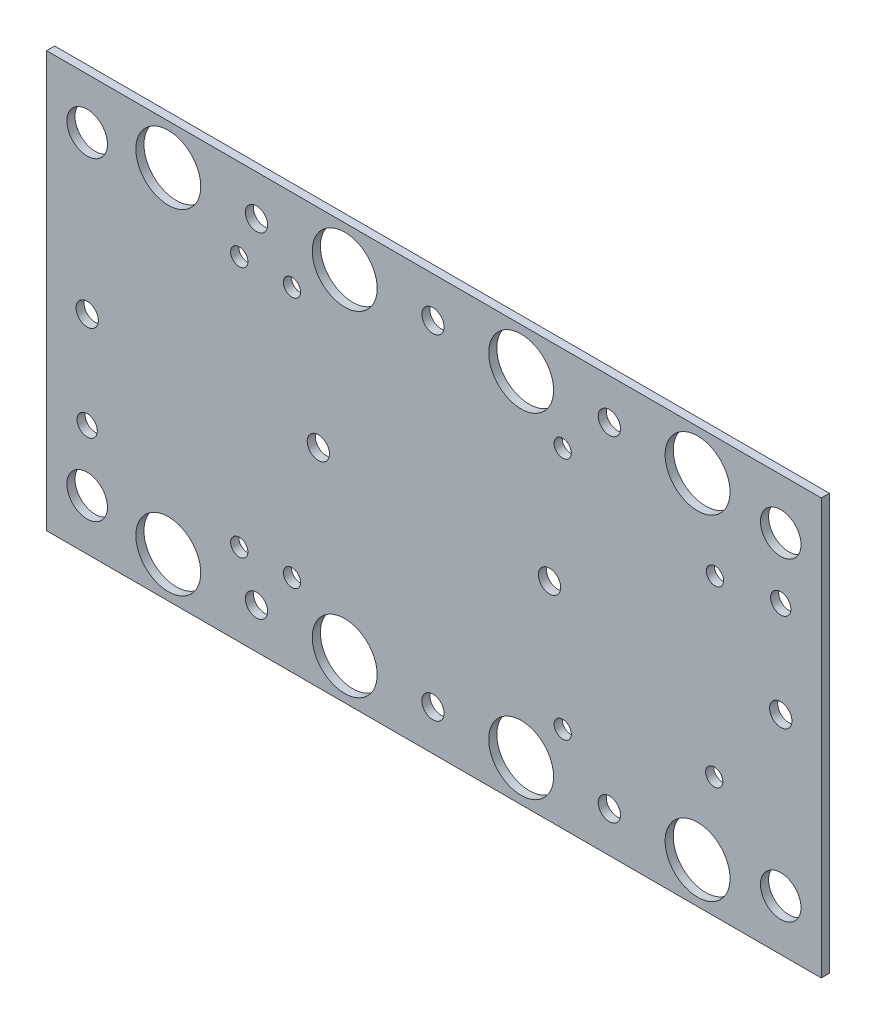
ISO-10303-21;
HEADER;
FILE_DESCRIPTION(('STEP AP214'),'2;1');
FILE_NAME('part.step','',(''),(''),'','','');
FILE_SCHEMA(('AUTOMOTIVE_DESIGN { 1 0 10303 214 1 1 1 1 }'));
ENDSEC;
DATA;
#1=APPLICATION_CONTEXT('core data for automotive mechanical design processes');
#2=APPLICATION_PROTOCOL_DEFINITION('international standard','automotive_design',2000,#1);
#3=PRODUCT_CONTEXT('',#1,'mechanical');
#4=PRODUCT('Part','Part','',(#3));
#5=PRODUCT_RELATED_PRODUCT_CATEGORY('part','',(#4));
#6=PRODUCT_DEFINITION_FORMATION('','',#4);
#7=PRODUCT_DEFINITION_CONTEXT('part definition',#1,'design');
#8=PRODUCT_DEFINITION('design','',#6,#7);
#9=PRODUCT_DEFINITION_SHAPE('','',#8);
#10=(LENGTH_UNIT() NAMED_UNIT(*) SI_UNIT(.MILLI.,.METRE.));
#11=(NAMED_UNIT(*) PLANE_ANGLE_UNIT() SI_UNIT($,.RADIAN.));
#12=(NAMED_UNIT(*) SI_UNIT($,.STERADIAN.) SOLID_ANGLE_UNIT());
#13=UNCERTAINTY_MEASURE_WITH_UNIT(LENGTH_MEASURE(1.E-05),#10,'distance_accuracy_value','');
#14=(GEOMETRIC_REPRESENTATION_CONTEXT(3) GLOBAL_UNCERTAINTY_ASSIGNED_CONTEXT((#13)) GLOBAL_UNIT_ASSIGNED_CONTEXT((#10,
#11,#12)) REPRESENTATION_CONTEXT('',''));
#15=CARTESIAN_POINT('',(0.,0.,0.));
#16=DIRECTION('',(0.,0.,1.));
#17=DIRECTION('',(1.,0.,0.));
#18=AXIS2_PLACEMENT_3D('',#15,#16,#17);
#19=CARTESIAN_POINT('',(19.9999999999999,-275.,4.));
#20=DIRECTION('',(0.,0.,1.));
#21=DIRECTION('',(1.,0.,0.));
#22=AXIS2_PLACEMENT_3D('',#19,#20,#21);
#23=PLANE('',#22);
#24=CARTESIAN_POINT('',(141.,-234.5,4.));
#25=DIRECTION('',(0.,0.,-1.));
#26=DIRECTION('',(-1.,0.,0.));
#27=AXIS2_PLACEMENT_3D('',#24,#25,#26);
#28=CIRCLE('',#27,4.25000000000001);
#29=CARTESIAN_POINT('',(136.75,-234.5,4.));
#30=VERTEX_POINT('',#29);
#31=EDGE_CURVE('E524',#30,#30,#28,.T.);
#32=ORIENTED_EDGE('',*,*,#31,.T.);
#33=EDGE_LOOP('',(#32));
#34=FACE_BOUND('',#33,.T.);
#35=CARTESIAN_POINT('',(115.,-234.5,4.));
#36=DIRECTION('',(0.,0.,-1.));
#37=DIRECTION('',(-1.,0.,0.));
#38=AXIS2_PLACEMENT_3D('',#35,#36,#37);
#39=CIRCLE('',#38,4.25000000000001);
#40=CARTESIAN_POINT('',(110.75,-234.5,4.));
#41=VERTEX_POINT('',#40);
#42=EDGE_CURVE('E534',#41,#41,#39,.T.);
#43=ORIENTED_EDGE('',*,*,#42,.T.);
#44=EDGE_LOOP('',(#43));
#45=FACE_BOUND('',#44,.T.);
#46=CARTESIAN_POINT('',(115.,-110.499999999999,4.));
#47=DIRECTION('',(0.,0.,-1.));
#48=DIRECTION('',(-1.,0.,0.));
#49=AXIS2_PLACEMENT_3D('',#46,#47,#48);
#50=CIRCLE('',#49,4.25000000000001);
#51=CARTESIAN_POINT('',(110.75,-110.499999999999,4.));
#52=VERTEX_POINT('',#51);
#53=EDGE_CURVE('E540',#52,#52,#50,.T.);
#54=ORIENTED_EDGE('',*,*,#53,.T.);
#55=EDGE_LOOP('',(#54));
#56=FACE_BOUND('',#55,.T.);
#57=CARTESIAN_POINT('',(141.,-110.499999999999,4.));
#58=DIRECTION('',(0.,0.,-1.));
#59=DIRECTION('',(-1.,0.,0.));
#60=AXIS2_PLACEMENT_3D('',#57,#58,#59);
#61=CIRCLE('',#60,4.25000000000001);
#62=CARTESIAN_POINT('',(136.75,-110.499999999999,4.));
#63=VERTEX_POINT('',#62);
#64=EDGE_CURVE('E546',#63,#63,#61,.T.);
#65=ORIENTED_EDGE('',*,*,#64,.T.);
#66=EDGE_LOOP('',(#65));
#67=FACE_BOUND('',#66,.T.);
#68=CARTESIAN_POINT('',(274.5,-232.499999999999,4.));
#69=DIRECTION('',(0.,0.,-1.));
#70=DIRECTION('',(-1.,0.,0.));
#71=AXIS2_PLACEMENT_3D('',#68,#69,#70);
#72=CIRCLE('',#71,4.24999999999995);
#73=CARTESIAN_POINT('',(270.25,-232.499999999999,4.));
#74=VERTEX_POINT('',#73);
#75=EDGE_CURVE('E552',#74,#74,#72,.T.);
#76=ORIENTED_EDGE('',*,*,#75,.T.);
#77=EDGE_LOOP('',(#76));
#78=FACE_BOUND('',#77,.T.);
#79=CARTESIAN_POINT('',(274.5,-112.499999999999,4.));
#80=DIRECTION('',(0.,0.,-1.));
#81=DIRECTION('',(-1.,0.,0.));
#82=AXIS2_PLACEMENT_3D('',#79,#80,#81);
#83=CIRCLE('',#82,4.24999999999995);
#84=CARTESIAN_POINT('',(270.25,-112.499999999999,4.));
#85=VERTEX_POINT('',#84);
#86=EDGE_CURVE('E558',#85,#85,#83,.T.);
#87=ORIENTED_EDGE('',*,*,#86,.T.);
#88=EDGE_LOOP('',(#87));
#89=FACE_BOUND('',#88,.T.);
#90=CARTESIAN_POINT('',(349.2132642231,-215.499999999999,4.));
#91=DIRECTION('',(0.,0.,-1.));
#92=DIRECTION('',(-1.,0.,0.));
#93=AXIS2_PLACEMENT_3D('',#90,#91,#92);
#94=CIRCLE('',#93,4.24999999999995);
#95=CARTESIAN_POINT('',(344.9632642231,-215.499999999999,4.));
#96=VERTEX_POINT('',#95);
#97=EDGE_CURVE('E564',#96,#96,#94,.T.);
#98=ORIENTED_EDGE('',*,*,#97,.T.);
#99=EDGE_LOOP('',(#98));
#100=FACE_BOUND('',#99,.T.);
#101=CARTESIAN_POINT('',(349.551704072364,-129.499999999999,4.));
#102=DIRECTION('',(0.,0.,-1.));
#103=DIRECTION('',(-1.,0.,0.));
#104=AXIS2_PLACEMENT_3D('',#101,#102,#103);
#105=CIRCLE('',#104,4.24999999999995);
#106=CARTESIAN_POINT('',(345.301704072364,-129.499999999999,4.));
#107=VERTEX_POINT('',#106);
#108=EDGE_CURVE('E570',#107,#107,#105,.T.);
#109=ORIENTED_EDGE('',*,*,#108,.T.);
#110=EDGE_LOOP('',(#109));
#111=FACE_BOUND('',#110,.T.);
#112=CARTESIAN_POINT('',(39.9999999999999,-220.,4.));
#113=DIRECTION('',(0.,0.,1.));
#114=DIRECTION('',(1.,0.,0.));
#115=AXIS2_PLACEMENT_3D('',#112,#113,#114);
#116=CIRCLE('',#115,5.);
#117=CARTESIAN_POINT('',(44.9999999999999,-220.,4.));
#118=VERTEX_POINT('',#117);
#119=EDGE_CURVE('E573',#118,#118,#116,.T.);
#120=ORIENTED_EDGE('',*,*,#119,.F.);
#121=EDGE_LOOP('',(#120));
#122=FACE_BOUND('',#121,.T.);
#123=CARTESIAN_POINT('',(382.,-125.,4.));
#124=DIRECTION('',(0.,0.,1.));
#125=DIRECTION('',(1.,0.,0.));
#126=AXIS2_PLACEMENT_3D('',#123,#124,#125);
#127=CIRCLE('',#126,4.99999999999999);
#128=CARTESIAN_POINT('',(387.,-125.,4.));
#129=VERTEX_POINT('',#128);
#130=EDGE_CURVE('E579',#129,#129,#127,.T.);
#131=ORIENTED_EDGE('',*,*,#130,.F.);
#132=EDGE_LOOP('',(#131));
#133=FACE_BOUND('',#132,.T.);
#134=CARTESIAN_POINT('',(297.5,-255.,4.));
#135=DIRECTION('',(0.,0.,-1.));
#136=DIRECTION('',(-1.,0.,0.));
#137=AXIS2_PLACEMENT_3D('',#134,#135,#136);
#138=CIRCLE('',#137,5.50000000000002);
#139=CARTESIAN_POINT('',(292.,-255.,4.));
#140=VERTEX_POINT('',#139);
#141=EDGE_CURVE('E588',#140,#140,#138,.T.);
#142=ORIENTED_EDGE('',*,*,#141,.T.);
#143=EDGE_LOOP('',(#142));
#144=FACE_BOUND('',#143,.T.);
#145=CARTESIAN_POINT('',(210.5,-255.,4.));
#146=DIRECTION('',(0.,0.,-1.));
#147=DIRECTION('',(-1.,0.,0.));
#148=AXIS2_PLACEMENT_3D('',#145,#146,#147);
#149=CIRCLE('',#148,5.50000000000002);
#150=CARTESIAN_POINT('',(205.,-255.,4.));
#151=VERTEX_POINT('',#150);
#152=EDGE_CURVE('E594',#151,#151,#149,.T.);
#153=ORIENTED_EDGE('',*,*,#152,.T.);
#154=EDGE_LOOP('',(#153));
#155=FACE_BOUND('',#154,.T.);
#156=CARTESIAN_POINT('',(123.499999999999,-255.,4.));
#157=DIRECTION('',(0.,0.,-1.));
#158=DIRECTION('',(-1.,0.,0.));
#159=AXIS2_PLACEMENT_3D('',#156,#157,#158);
#160=CIRCLE('',#159,5.5);
#161=CARTESIAN_POINT('',(117.999999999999,-255.,4.));
#162=VERTEX_POINT('',#161);
#163=EDGE_CURVE('E600',#162,#162,#160,.T.);
#164=ORIENTED_EDGE('',*,*,#163,.T.);
#165=EDGE_LOOP('',(#164));
#166=FACE_BOUND('',#165,.T.);
#167=CARTESIAN_POINT('',(39.9999999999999,-172.499999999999,4.));
#168=DIRECTION('',(0.,0.,-1.));
#169=DIRECTION('',(-1.,0.,0.));
#170=AXIS2_PLACEMENT_3D('',#167,#168,#169);
#171=CIRCLE('',#170,5.5);
#172=CARTESIAN_POINT('',(34.4999999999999,-172.499999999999,4.));
#173=VERTEX_POINT('',#172);
#174=EDGE_CURVE('E606',#173,#173,#171,.T.);
#175=ORIENTED_EDGE('',*,*,#174,.T.);
#176=EDGE_LOOP('',(#175));
#177=FACE_BOUND('',#176,.T.);
#178=CARTESIAN_POINT('',(154.,-172.499999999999,4.));
#179=DIRECTION('',(0.,0.,-1.));
#180=DIRECTION('',(-1.,0.,0.));
#181=AXIS2_PLACEMENT_3D('',#178,#179,#180);
#182=CIRCLE('',#181,5.50000000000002);
#183=CARTESIAN_POINT('',(148.5,-172.499999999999,4.));
#184=VERTEX_POINT('',#183);
#185=EDGE_CURVE('E612',#184,#184,#182,.T.);
#186=ORIENTED_EDGE('',*,*,#185,.T.);
#187=EDGE_LOOP('',(#186));
#188=FACE_BOUND('',#187,.T.);
#189=CARTESIAN_POINT('',(268.,-172.499999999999,4.));
#190=DIRECTION('',(0.,0.,-1.));
#191=DIRECTION('',(-1.,0.,0.));
#192=AXIS2_PLACEMENT_3D('',#189,#190,#191);
#193=CIRCLE('',#192,5.50000000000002);
#194=CARTESIAN_POINT('',(262.5,-172.499999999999,4.));
#195=VERTEX_POINT('',#194);
#196=EDGE_CURVE('E618',#195,#195,#193,.T.);
#197=ORIENTED_EDGE('',*,*,#196,.T.);
#198=EDGE_LOOP('',(#197));
#199=FACE_BOUND('',#198,.T.);
#200=CARTESIAN_POINT('',(382.,-172.499999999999,4.));
#201=DIRECTION('',(0.,0.,-1.));
#202=DIRECTION('',(-1.,0.,0.));
#203=AXIS2_PLACEMENT_3D('',#200,#201,#202);
#204=CIRCLE('',#203,5.50000000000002);
#205=CARTESIAN_POINT('',(376.5,-172.499999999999,4.));
#206=VERTEX_POINT('',#205);
#207=EDGE_CURVE('E624',#206,#206,#204,.T.);
#208=ORIENTED_EDGE('',*,*,#207,.T.);
#209=EDGE_LOOP('',(#208));
#210=FACE_BOUND('',#209,.T.);
#211=CARTESIAN_POINT('',(123.5,-89.9999999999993,4.));
#212=DIRECTION('',(0.,0.,-1.));
#213=DIRECTION('',(-1.,0.,0.));
#214=AXIS2_PLACEMENT_3D('',#211,#212,#213);
#215=CIRCLE('',#214,5.5);
#216=CARTESIAN_POINT('',(118.,-89.9999999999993,4.));
#217=VERTEX_POINT('',#216);
#218=EDGE_CURVE('E630',#217,#217,#215,.T.);
#219=ORIENTED_EDGE('',*,*,#218,.T.);
#220=EDGE_LOOP('',(#219));
#221=FACE_BOUND('',#220,.T.);
#222=CARTESIAN_POINT('',(210.5,-89.9999999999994,4.));
#223=DIRECTION('',(0.,0.,-1.));
#224=DIRECTION('',(-1.,0.,0.));
#225=AXIS2_PLACEMENT_3D('',#222,#223,#224);
#226=CIRCLE('',#225,5.50000000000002);
#227=CARTESIAN_POINT('',(205.,-89.9999999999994,4.));
#228=VERTEX_POINT('',#227);
#229=EDGE_CURVE('E636',#228,#228,#226,.T.);
#230=ORIENTED_EDGE('',*,*,#229,.T.);
#231=EDGE_LOOP('',(#230));
#232=FACE_BOUND('',#231,.T.);
#233=CARTESIAN_POINT('',(297.5,-89.9999999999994,4.));
#234=DIRECTION('',(0.,0.,-1.));
#235=DIRECTION('',(-1.,0.,0.));
#236=AXIS2_PLACEMENT_3D('',#233,#234,#235);
#237=CIRCLE('',#236,5.50000000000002);
#238=CARTESIAN_POINT('',(292.,-89.9999999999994,4.));
#239=VERTEX_POINT('',#238);
#240=EDGE_CURVE('E147',#239,#239,#237,.T.);
#241=ORIENTED_EDGE('',*,*,#240,.T.);
#242=EDGE_LOOP('',(#241));
#243=FACE_BOUND('',#242,.T.);
#244=CARTESIAN_POINT('',(167.,-255.,4.));
#245=DIRECTION('',(0.,0.,1.));
#246=DIRECTION('',(1.,0.,0.));
#247=AXIS2_PLACEMENT_3D('',#244,#245,#246);
#248=CIRCLE('',#247,16.);
#249=CARTESIAN_POINT('',(183.,-255.,4.));
#250=VERTEX_POINT('',#249);
#251=EDGE_CURVE('E144',#250,#250,#248,.T.);
#252=ORIENTED_EDGE('',*,*,#251,.F.);
#253=EDGE_LOOP('',(#252));
#254=FACE_BOUND('',#253,.T.);
#255=CARTESIAN_POINT('',(341.,-255.,4.));
#256=DIRECTION('',(0.,0.,1.));
#257=DIRECTION('',(1.,0.,0.));
#258=AXIS2_PLACEMENT_3D('',#255,#256,#257);
#259=CIRCLE('',#258,16.0000000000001);
#260=CARTESIAN_POINT('',(357.,-255.,4.));
#261=VERTEX_POINT('',#260);
#262=EDGE_CURVE('E160',#261,#261,#259,.T.);
#263=ORIENTED_EDGE('',*,*,#262,.F.);
#264=EDGE_LOOP('',(#263));
#265=FACE_BOUND('',#264,.T.);
#266=CARTESIAN_POINT('',(39.9999999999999,-95.,4.));
#267=DIRECTION('',(0.,0.,1.));
#268=DIRECTION('',(1.,0.,0.));
#269=AXIS2_PLACEMENT_3D('',#266,#267,#268);
#270=CIRCLE('',#269,10.);
#271=CARTESIAN_POINT('',(49.9999999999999,-95.,4.));
#272=VERTEX_POINT('',#271);
#273=EDGE_CURVE('E170',#272,#272,#270,.T.);
#274=ORIENTED_EDGE('',*,*,#273,.F.);
#275=EDGE_LOOP('',(#274));
#276=FACE_BOUND('',#275,.T.);
#277=CARTESIAN_POINT('',(382.,-250.,4.));
#278=DIRECTION('',(0.,0.,1.));
#279=DIRECTION('',(1.,0.,0.));
#280=AXIS2_PLACEMENT_3D('',#277,#278,#279);
#281=CIRCLE('',#280,9.99999999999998);
#282=CARTESIAN_POINT('',(392.,-250.,4.));
#283=VERTEX_POINT('',#282);
#284=EDGE_CURVE('E180',#283,#283,#281,.T.);
#285=ORIENTED_EDGE('',*,*,#284,.F.);
#286=EDGE_LOOP('',(#285));
#287=FACE_BOUND('',#286,.T.);
#288=CARTESIAN_POINT('',(167.,-90.,4.));
#289=DIRECTION('',(0.,0.,1.));
#290=DIRECTION('',(1.,0.,0.));
#291=AXIS2_PLACEMENT_3D('',#288,#289,#290);
#292=CIRCLE('',#291,16.);
#293=CARTESIAN_POINT('',(183.,-90.,4.));
#294=VERTEX_POINT('',#293);
#295=EDGE_CURVE('E190',#294,#294,#292,.T.);
#296=ORIENTED_EDGE('',*,*,#295,.F.);
#297=EDGE_LOOP('',(#296));
#298=FACE_BOUND('',#297,.T.);
#299=CARTESIAN_POINT('',(341.,-90.,4.));
#300=DIRECTION('',(0.,0.,1.));
#301=DIRECTION('',(1.,0.,0.));
#302=AXIS2_PLACEMENT_3D('',#299,#300,#301);
#303=CIRCLE('',#302,16.0000000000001);
#304=CARTESIAN_POINT('',(357.,-90.,4.));
#305=VERTEX_POINT('',#304);
#306=EDGE_CURVE('E90',#305,#305,#303,.T.);
#307=ORIENTED_EDGE('',*,*,#306,.F.);
#308=EDGE_LOOP('',(#307));
#309=FACE_BOUND('',#308,.T.);
#310=DIRECTION('',(0.,-1.,0.));
#311=VECTOR('',#310,1.);
#312=CARTESIAN_POINT('',(19.9999999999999,-70.,4.));
#313=LINE('',#312,#311);
#314=CARTESIAN_POINT('',(19.9999999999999,-70.,4.));
#315=VERTEX_POINT('',#314);
#316=CARTESIAN_POINT('',(19.9999999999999,-275.,4.));
#317=VERTEX_POINT('',#316);
#318=EDGE_CURVE('E100',#315,#317,#313,.T.);
#319=ORIENTED_EDGE('',*,*,#318,.T.);
#320=DIRECTION('',(1.,0.,0.));
#321=VECTOR('',#320,1.);
#322=CARTESIAN_POINT('',(19.9999999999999,-275.,4.));
#323=LINE('',#322,#321);
#324=CARTESIAN_POINT('',(402.,-275.,4.));
#325=VERTEX_POINT('',#324);
#326=EDGE_CURVE('E85',#317,#325,#323,.T.);
#327=ORIENTED_EDGE('',*,*,#326,.T.);
#328=DIRECTION('',(0.,1.,0.));
#329=VECTOR('',#328,1.);
#330=CARTESIAN_POINT('',(402.,-275.,4.));
#331=LINE('',#330,#329);
#332=CARTESIAN_POINT('',(402.,-70.,4.));
#333=VERTEX_POINT('',#332);
#334=EDGE_CURVE('E51',#325,#333,#331,.T.);
#335=ORIENTED_EDGE('',*,*,#334,.T.);
#336=DIRECTION('',(-1.,0.,0.));
#337=VECTOR('',#336,1.);
#338=CARTESIAN_POINT('',(402.,-70.,4.));
#339=LINE('',#338,#337);
#340=EDGE_CURVE('E46',#333,#315,#339,.T.);
#341=ORIENTED_EDGE('',*,*,#340,.T.);
#342=EDGE_LOOP('',(#319,#327,#335,#341));
#343=FACE_BOUND('',#342,.T.);
#344=CARTESIAN_POINT('',(254.,-90.,4.));
#345=DIRECTION('',(0.,0.,1.));
#346=DIRECTION('',(1.,0.,0.));
#347=AXIS2_PLACEMENT_3D('',#344,#345,#346);
#348=CIRCLE('',#347,16.);
#349=CARTESIAN_POINT('',(270.,-90.,4.));
#350=VERTEX_POINT('',#349);
#351=EDGE_CURVE('E119',#350,#350,#348,.T.);
#352=ORIENTED_EDGE('',*,*,#351,.F.);
#353=EDGE_LOOP('',(#352));
#354=FACE_BOUND('',#353,.T.);
#355=CARTESIAN_POINT('',(79.9999999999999,-90.,4.));
#356=DIRECTION('',(0.,0.,1.));
#357=DIRECTION('',(1.,0.,0.));
#358=AXIS2_PLACEMENT_3D('',#355,#356,#357);
#359=CIRCLE('',#358,16.);
#360=CARTESIAN_POINT('',(95.9999999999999,-90.,4.));
#361=VERTEX_POINT('',#360);
#362=EDGE_CURVE('E123',#361,#361,#359,.T.);
#363=ORIENTED_EDGE('',*,*,#362,.F.);
#364=EDGE_LOOP('',(#363));
#365=FACE_BOUND('',#364,.T.);
#366=CARTESIAN_POINT('',(39.9999999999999,-250.,4.));
#367=DIRECTION('',(0.,0.,1.));
#368=DIRECTION('',(1.,0.,0.));
#369=AXIS2_PLACEMENT_3D('',#366,#367,#368);
#370=CIRCLE('',#369,10.);
#371=CARTESIAN_POINT('',(49.9999999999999,-250.,4.));
#372=VERTEX_POINT('',#371);
#373=EDGE_CURVE('E127',#372,#372,#370,.T.);
#374=ORIENTED_EDGE('',*,*,#373,.F.);
#375=EDGE_LOOP('',(#374));
#376=FACE_BOUND('',#375,.T.);
#377=CARTESIAN_POINT('',(382.,-95.,4.));
#378=DIRECTION('',(0.,0.,1.));
#379=DIRECTION('',(1.,0.,0.));
#380=AXIS2_PLACEMENT_3D('',#377,#378,#379);
#381=CIRCLE('',#380,10.);
#382=CARTESIAN_POINT('',(392.,-95.,4.));
#383=VERTEX_POINT('',#382);
#384=EDGE_CURVE('E131',#383,#383,#381,.T.);
#385=ORIENTED_EDGE('',*,*,#384,.F.);
#386=EDGE_LOOP('',(#385));
#387=FACE_BOUND('',#386,.T.);
#388=CARTESIAN_POINT('',(254.,-255.,4.));
#389=DIRECTION('',(0.,0.,1.));
#390=DIRECTION('',(1.,0.,0.));
#391=AXIS2_PLACEMENT_3D('',#388,#389,#390);
#392=CIRCLE('',#391,16.);
#393=CARTESIAN_POINT('',(270.,-255.,4.));
#394=VERTEX_POINT('',#393);
#395=EDGE_CURVE('E135',#394,#394,#392,.T.);
#396=ORIENTED_EDGE('',*,*,#395,.F.);
#397=EDGE_LOOP('',(#396));
#398=FACE_BOUND('',#397,.T.);
#399=CARTESIAN_POINT('',(79.9999999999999,-255.,4.));
#400=DIRECTION('',(0.,0.,1.));
#401=DIRECTION('',(1.,0.,0.));
#402=AXIS2_PLACEMENT_3D('',#399,#400,#401);
#403=CIRCLE('',#402,16.);
#404=CARTESIAN_POINT('',(95.9999999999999,-255.,4.));
#405=VERTEX_POINT('',#404);
#406=EDGE_CURVE('E138',#405,#405,#403,.T.);
#407=ORIENTED_EDGE('',*,*,#406,.F.);
#408=EDGE_LOOP('',(#407));
#409=FACE_BOUND('',#408,.T.);
#410=ADVANCED_FACE('F31',(#34,#45,#56,#67,#78,#89,#100,#111,#122,#133,#144,#155,#166,#177,#188,
#199,#210,#221,#232,#243,#254,#265,#276,#287,#298,#309,#343,#354,#365,#376,#387,#398,#409),#23,.T.);
#411=CARTESIAN_POINT('',(19.9999999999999,-275.,0.));
#412=DIRECTION('',(0.,0.,1.));
#413=DIRECTION('',(1.,0.,0.));
#414=AXIS2_PLACEMENT_3D('',#411,#412,#413);
#415=PLANE('',#414);
#416=CARTESIAN_POINT('',(141.,-234.5,0.));
#417=DIRECTION('',(0.,0.,-1.));
#418=DIRECTION('',(-1.,0.,0.));
#419=AXIS2_PLACEMENT_3D('',#416,#417,#418);
#420=CIRCLE('',#419,4.25000000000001);
#421=CARTESIAN_POINT('',(136.75,-234.5,0.));
#422=VERTEX_POINT('',#421);
#423=EDGE_CURVE('E527',#422,#422,#420,.T.);
#424=ORIENTED_EDGE('',*,*,#423,.F.);
#425=EDGE_LOOP('',(#424));
#426=FACE_BOUND('',#425,.T.);
#427=CARTESIAN_POINT('',(115.,-234.5,0.));
#428=DIRECTION('',(0.,0.,-1.));
#429=DIRECTION('',(-1.,0.,0.));
#430=AXIS2_PLACEMENT_3D('',#427,#428,#429);
#431=CIRCLE('',#430,4.25000000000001);
#432=CARTESIAN_POINT('',(110.75,-234.5,0.));
#433=VERTEX_POINT('',#432);
#434=EDGE_CURVE('E529',#433,#433,#431,.T.);
#435=ORIENTED_EDGE('',*,*,#434,.F.);
#436=EDGE_LOOP('',(#435));
#437=FACE_BOUND('',#436,.T.);
#438=CARTESIAN_POINT('',(115.,-110.499999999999,0.));
#439=DIRECTION('',(0.,0.,-1.));
#440=DIRECTION('',(-1.,0.,0.));
#441=AXIS2_PLACEMENT_3D('',#438,#439,#440);
#442=CIRCLE('',#441,4.25000000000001);
#443=CARTESIAN_POINT('',(110.75,-110.499999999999,0.));
#444=VERTEX_POINT('',#443);
#445=EDGE_CURVE('E537',#444,#444,#442,.T.);
#446=ORIENTED_EDGE('',*,*,#445,.F.);
#447=EDGE_LOOP('',(#446));
#448=FACE_BOUND('',#447,.T.);
#449=CARTESIAN_POINT('',(141.,-110.499999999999,0.));
#450=DIRECTION('',(0.,0.,-1.));
#451=DIRECTION('',(-1.,0.,0.));
#452=AXIS2_PLACEMENT_3D('',#449,#450,#451);
#453=CIRCLE('',#452,4.25000000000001);
#454=CARTESIAN_POINT('',(136.75,-110.499999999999,0.));
#455=VERTEX_POINT('',#454);
#456=EDGE_CURVE('E543',#455,#455,#453,.T.);
#457=ORIENTED_EDGE('',*,*,#456,.F.);
#458=EDGE_LOOP('',(#457));
#459=FACE_BOUND('',#458,.T.);
#460=CARTESIAN_POINT('',(274.5,-232.499999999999,0.));
#461=DIRECTION('',(0.,0.,-1.));
#462=DIRECTION('',(-1.,0.,0.));
#463=AXIS2_PLACEMENT_3D('',#460,#461,#462);
#464=CIRCLE('',#463,4.24999999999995);
#465=CARTESIAN_POINT('',(270.25,-232.499999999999,0.));
#466=VERTEX_POINT('',#465);
#467=EDGE_CURVE('E549',#466,#466,#464,.T.);
#468=ORIENTED_EDGE('',*,*,#467,.F.);
#469=EDGE_LOOP('',(#468));
#470=FACE_BOUND('',#469,.T.);
#471=CARTESIAN_POINT('',(274.5,-112.499999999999,0.));
#472=DIRECTION('',(0.,0.,-1.));
#473=DIRECTION('',(-1.,0.,0.));
#474=AXIS2_PLACEMENT_3D('',#471,#472,#473);
#475=CIRCLE('',#474,4.24999999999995);
#476=CARTESIAN_POINT('',(270.25,-112.499999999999,0.));
#477=VERTEX_POINT('',#476);
#478=EDGE_CURVE('E555',#477,#477,#475,.T.);
#479=ORIENTED_EDGE('',*,*,#478,.F.);
#480=EDGE_LOOP('',(#479));
#481=FACE_BOUND('',#480,.T.);
#482=CARTESIAN_POINT('',(349.2132642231,-215.499999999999,0.));
#483=DIRECTION('',(0.,0.,-1.));
#484=DIRECTION('',(-1.,0.,0.));
#485=AXIS2_PLACEMENT_3D('',#482,#483,#484);
#486=CIRCLE('',#485,4.24999999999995);
#487=CARTESIAN_POINT('',(344.9632642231,-215.499999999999,0.));
#488=VERTEX_POINT('',#487);
#489=EDGE_CURVE('E561',#488,#488,#486,.T.);
#490=ORIENTED_EDGE('',*,*,#489,.F.);
#491=EDGE_LOOP('',(#490));
#492=FACE_BOUND('',#491,.T.);
#493=CARTESIAN_POINT('',(349.551704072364,-129.499999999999,0.));
#494=DIRECTION('',(0.,0.,-1.));
#495=DIRECTION('',(-1.,0.,0.));
#496=AXIS2_PLACEMENT_3D('',#493,#494,#495);
#497=CIRCLE('',#496,4.24999999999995);
#498=CARTESIAN_POINT('',(345.301704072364,-129.499999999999,0.));
#499=VERTEX_POINT('',#498);
#500=EDGE_CURVE('E567',#499,#499,#497,.T.);
#501=ORIENTED_EDGE('',*,*,#500,.F.);
#502=EDGE_LOOP('',(#501));
#503=FACE_BOUND('',#502,.T.);
#504=CARTESIAN_POINT('',(39.9999999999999,-220.,0.));
#505=DIRECTION('',(0.,0.,1.));
#506=DIRECTION('',(1.,0.,0.));
#507=AXIS2_PLACEMENT_3D('',#504,#505,#506);
#508=CIRCLE('',#507,5.);
#509=CARTESIAN_POINT('',(44.9999999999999,-220.,0.));
#510=VERTEX_POINT('',#509);
#511=EDGE_CURVE('E576',#510,#510,#508,.T.);
#512=ORIENTED_EDGE('',*,*,#511,.T.);
#513=EDGE_LOOP('',(#512));
#514=FACE_BOUND('',#513,.T.);
#515=CARTESIAN_POINT('',(382.,-125.,0.));
#516=DIRECTION('',(0.,0.,1.));
#517=DIRECTION('',(1.,0.,0.));
#518=AXIS2_PLACEMENT_3D('',#515,#516,#517);
#519=CIRCLE('',#518,4.99999999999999);
#520=CARTESIAN_POINT('',(387.,-125.,0.));
#521=VERTEX_POINT('',#520);
#522=EDGE_CURVE('E582',#521,#521,#519,.T.);
#523=ORIENTED_EDGE('',*,*,#522,.T.);
#524=EDGE_LOOP('',(#523));
#525=FACE_BOUND('',#524,.T.);
#526=CARTESIAN_POINT('',(297.5,-255.,0.));
#527=DIRECTION('',(0.,0.,-1.));
#528=DIRECTION('',(-1.,0.,0.));
#529=AXIS2_PLACEMENT_3D('',#526,#527,#528);
#530=CIRCLE('',#529,5.50000000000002);
#531=CARTESIAN_POINT('',(292.,-255.,0.));
#532=VERTEX_POINT('',#531);
#533=EDGE_CURVE('E585',#532,#532,#530,.T.);
#534=ORIENTED_EDGE('',*,*,#533,.F.);
#535=EDGE_LOOP('',(#534));
#536=FACE_BOUND('',#535,.T.);
#537=CARTESIAN_POINT('',(210.5,-255.,0.));
#538=DIRECTION('',(0.,0.,-1.));
#539=DIRECTION('',(-1.,0.,0.));
#540=AXIS2_PLACEMENT_3D('',#537,#538,#539);
#541=CIRCLE('',#540,5.50000000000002);
#542=CARTESIAN_POINT('',(205.,-255.,0.));
#543=VERTEX_POINT('',#542);
#544=EDGE_CURVE('E591',#543,#543,#541,.T.);
#545=ORIENTED_EDGE('',*,*,#544,.F.);
#546=EDGE_LOOP('',(#545));
#547=FACE_BOUND('',#546,.T.);
#548=CARTESIAN_POINT('',(123.499999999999,-255.,0.));
#549=DIRECTION('',(0.,0.,-1.));
#550=DIRECTION('',(-1.,0.,0.));
#551=AXIS2_PLACEMENT_3D('',#548,#549,#550);
#552=CIRCLE('',#551,5.5);
#553=CARTESIAN_POINT('',(117.999999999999,-255.,0.));
#554=VERTEX_POINT('',#553);
#555=EDGE_CURVE('E597',#554,#554,#552,.T.);
#556=ORIENTED_EDGE('',*,*,#555,.F.);
#557=EDGE_LOOP('',(#556));
#558=FACE_BOUND('',#557,.T.);
#559=CARTESIAN_POINT('',(39.9999999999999,-172.499999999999,0.));
#560=DIRECTION('',(0.,0.,-1.));
#561=DIRECTION('',(-1.,0.,0.));
#562=AXIS2_PLACEMENT_3D('',#559,#560,#561);
#563=CIRCLE('',#562,5.5);
#564=CARTESIAN_POINT('',(34.4999999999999,-172.499999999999,0.));
#565=VERTEX_POINT('',#564);
#566=EDGE_CURVE('E603',#565,#565,#563,.T.);
#567=ORIENTED_EDGE('',*,*,#566,.F.);
#568=EDGE_LOOP('',(#567));
#569=FACE_BOUND('',#568,.T.);
#570=CARTESIAN_POINT('',(154.,-172.499999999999,0.));
#571=DIRECTION('',(0.,0.,-1.));
#572=DIRECTION('',(-1.,0.,0.));
#573=AXIS2_PLACEMENT_3D('',#570,#571,#572);
#574=CIRCLE('',#573,5.50000000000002);
#575=CARTESIAN_POINT('',(148.5,-172.499999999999,0.));
#576=VERTEX_POINT('',#575);
#577=EDGE_CURVE('E609',#576,#576,#574,.T.);
#578=ORIENTED_EDGE('',*,*,#577,.F.);
#579=EDGE_LOOP('',(#578));
#580=FACE_BOUND('',#579,.T.);
#581=CARTESIAN_POINT('',(268.,-172.499999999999,0.));
#582=DIRECTION('',(0.,0.,-1.));
#583=DIRECTION('',(-1.,0.,0.));
#584=AXIS2_PLACEMENT_3D('',#581,#582,#583);
#585=CIRCLE('',#584,5.50000000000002);
#586=CARTESIAN_POINT('',(262.5,-172.499999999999,0.));
#587=VERTEX_POINT('',#586);
#588=EDGE_CURVE('E615',#587,#587,#585,.T.);
#589=ORIENTED_EDGE('',*,*,#588,.F.);
#590=EDGE_LOOP('',(#589));
#591=FACE_BOUND('',#590,.T.);
#592=CARTESIAN_POINT('',(382.,-172.499999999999,0.));
#593=DIRECTION('',(0.,0.,-1.));
#594=DIRECTION('',(-1.,0.,0.));
#595=AXIS2_PLACEMENT_3D('',#592,#593,#594);
#596=CIRCLE('',#595,5.50000000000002);
#597=CARTESIAN_POINT('',(376.5,-172.499999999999,0.));
#598=VERTEX_POINT('',#597);
#599=EDGE_CURVE('E621',#598,#598,#596,.T.);
#600=ORIENTED_EDGE('',*,*,#599,.F.);
#601=EDGE_LOOP('',(#600));
#602=FACE_BOUND('',#601,.T.);
#603=CARTESIAN_POINT('',(123.5,-89.9999999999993,0.));
#604=DIRECTION('',(0.,0.,-1.));
#605=DIRECTION('',(-1.,0.,0.));
#606=AXIS2_PLACEMENT_3D('',#603,#604,#605);
#607=CIRCLE('',#606,5.5);
#608=CARTESIAN_POINT('',(118.,-89.9999999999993,0.));
#609=VERTEX_POINT('',#608);
#610=EDGE_CURVE('E627',#609,#609,#607,.T.);
#611=ORIENTED_EDGE('',*,*,#610,.F.);
#612=EDGE_LOOP('',(#611));
#613=FACE_BOUND('',#612,.T.);
#614=CARTESIAN_POINT('',(210.5,-89.9999999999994,0.));
#615=DIRECTION('',(0.,0.,-1.));
#616=DIRECTION('',(-1.,0.,0.));
#617=AXIS2_PLACEMENT_3D('',#614,#615,#616);
#618=CIRCLE('',#617,5.50000000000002);
#619=CARTESIAN_POINT('',(205.,-89.9999999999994,0.));
#620=VERTEX_POINT('',#619);
#621=EDGE_CURVE('E633',#620,#620,#618,.T.);
#622=ORIENTED_EDGE('',*,*,#621,.F.);
#623=EDGE_LOOP('',(#622));
#624=FACE_BOUND('',#623,.T.);
#625=CARTESIAN_POINT('',(297.5,-89.9999999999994,0.));
#626=DIRECTION('',(0.,0.,-1.));
#627=DIRECTION('',(-1.,0.,0.));
#628=AXIS2_PLACEMENT_3D('',#625,#626,#627);
#629=CIRCLE('',#628,5.50000000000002);
#630=CARTESIAN_POINT('',(292.,-89.9999999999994,0.));
#631=VERTEX_POINT('',#630);
#632=EDGE_CURVE('E639',#631,#631,#629,.T.);
#633=ORIENTED_EDGE('',*,*,#632,.F.);
#634=EDGE_LOOP('',(#633));
#635=FACE_BOUND('',#634,.T.);
#636=CARTESIAN_POINT('',(167.,-255.,0.));
#637=DIRECTION('',(0.,0.,1.));
#638=DIRECTION('',(1.,0.,0.));
#639=AXIS2_PLACEMENT_3D('',#636,#637,#638);
#640=CIRCLE('',#639,16.);
#641=CARTESIAN_POINT('',(183.,-255.,0.));
#642=VERTEX_POINT('',#641);
#643=EDGE_CURVE('E140',#642,#642,#640,.T.);
#644=ORIENTED_EDGE('',*,*,#643,.T.);
#645=EDGE_LOOP('',(#644));
#646=FACE_BOUND('',#645,.T.);
#647=CARTESIAN_POINT('',(341.,-255.,0.));
#648=DIRECTION('',(0.,0.,1.));
#649=DIRECTION('',(1.,0.,0.));
#650=AXIS2_PLACEMENT_3D('',#647,#648,#649);
#651=CIRCLE('',#650,16.0000000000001);
#652=CARTESIAN_POINT('',(357.,-255.,0.));
#653=VERTEX_POINT('',#652);
#654=EDGE_CURVE('E157',#653,#653,#651,.T.);
#655=ORIENTED_EDGE('',*,*,#654,.T.);
#656=EDGE_LOOP('',(#655));
#657=FACE_BOUND('',#656,.T.);
#658=CARTESIAN_POINT('',(39.9999999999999,-95.,0.));
#659=DIRECTION('',(0.,0.,1.));
#660=DIRECTION('',(1.,0.,0.));
#661=AXIS2_PLACEMENT_3D('',#658,#659,#660);
#662=CIRCLE('',#661,10.);
#663=CARTESIAN_POINT('',(49.9999999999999,-95.,0.));
#664=VERTEX_POINT('',#663);
#665=EDGE_CURVE('E167',#664,#664,#662,.T.);
#666=ORIENTED_EDGE('',*,*,#665,.T.);
#667=EDGE_LOOP('',(#666));
#668=FACE_BOUND('',#667,.T.);
#669=CARTESIAN_POINT('',(382.,-250.,0.));
#670=DIRECTION('',(0.,0.,1.));
#671=DIRECTION('',(1.,0.,0.));
#672=AXIS2_PLACEMENT_3D('',#669,#670,#671);
#673=CIRCLE('',#672,9.99999999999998);
#674=CARTESIAN_POINT('',(392.,-250.,0.));
#675=VERTEX_POINT('',#674);
#676=EDGE_CURVE('E177',#675,#675,#673,.T.);
#677=ORIENTED_EDGE('',*,*,#676,.T.);
#678=EDGE_LOOP('',(#677));
#679=FACE_BOUND('',#678,.T.);
#680=CARTESIAN_POINT('',(167.,-90.,0.));
#681=DIRECTION('',(0.,0.,1.));
#682=DIRECTION('',(1.,0.,0.));
#683=AXIS2_PLACEMENT_3D('',#680,#681,#682);
#684=CIRCLE('',#683,16.);
#685=CARTESIAN_POINT('',(183.,-90.,0.));
#686=VERTEX_POINT('',#685);
#687=EDGE_CURVE('E187',#686,#686,#684,.T.);
#688=ORIENTED_EDGE('',*,*,#687,.T.);
#689=EDGE_LOOP('',(#688));
#690=FACE_BOUND('',#689,.T.);
#691=CARTESIAN_POINT('',(341.,-90.,0.));
#692=DIRECTION('',(0.,0.,1.));
#693=DIRECTION('',(1.,0.,0.));
#694=AXIS2_PLACEMENT_3D('',#691,#692,#693);
#695=CIRCLE('',#694,16.0000000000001);
#696=CARTESIAN_POINT('',(357.,-90.,0.));
#697=VERTEX_POINT('',#696);
#698=EDGE_CURVE('E93',#697,#697,#695,.T.);
#699=ORIENTED_EDGE('',*,*,#698,.T.);
#700=EDGE_LOOP('',(#699));
#701=FACE_BOUND('',#700,.T.);
#702=DIRECTION('',(0.,-1.,0.));
#703=VECTOR('',#702,1.);
#704=CARTESIAN_POINT('',(19.9999999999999,-70.,0.));
#705=LINE('',#704,#703);
#706=CARTESIAN_POINT('',(19.9999999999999,-70.,0.));
#707=VERTEX_POINT('',#706);
#708=CARTESIAN_POINT('',(19.9999999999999,-275.,0.));
#709=VERTEX_POINT('',#708);
#710=EDGE_CURVE('E77',#707,#709,#705,.T.);
#711=ORIENTED_EDGE('',*,*,#710,.F.);
#712=DIRECTION('',(-1.,0.,0.));
#713=VECTOR('',#712,1.);
#714=CARTESIAN_POINT('',(402.,-70.,0.));
#715=LINE('',#714,#713);
#716=CARTESIAN_POINT('',(402.,-70.,0.));
#717=VERTEX_POINT('',#716);
#718=EDGE_CURVE('E98',#717,#707,#715,.T.);
#719=ORIENTED_EDGE('',*,*,#718,.F.);
#720=DIRECTION('',(0.,1.,0.));
#721=VECTOR('',#720,1.);
#722=CARTESIAN_POINT('',(402.,-275.,0.));
#723=LINE('',#722,#721);
#724=CARTESIAN_POINT('',(402.,-275.,0.));
#725=VERTEX_POINT('',#724);
#726=EDGE_CURVE('E78',#725,#717,#723,.T.);
#727=ORIENTED_EDGE('',*,*,#726,.F.);
#728=DIRECTION('',(1.,0.,0.));
#729=VECTOR('',#728,1.);
#730=CARTESIAN_POINT('',(19.9999999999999,-275.,0.));
#731=LINE('',#730,#729);
#732=EDGE_CURVE('E72',#709,#725,#731,.T.);
#733=ORIENTED_EDGE('',*,*,#732,.F.);
#734=EDGE_LOOP('',(#711,#719,#727,#733));
#735=FACE_BOUND('',#734,.T.);
#736=CARTESIAN_POINT('',(254.,-90.,0.));
#737=DIRECTION('',(0.,0.,1.));
#738=DIRECTION('',(1.,0.,0.));
#739=AXIS2_PLACEMENT_3D('',#736,#737,#738);
#740=CIRCLE('',#739,16.);
#741=CARTESIAN_POINT('',(270.,-90.,0.));
#742=VERTEX_POINT('',#741);
#743=EDGE_CURVE('E193',#742,#742,#740,.T.);
#744=ORIENTED_EDGE('',*,*,#743,.T.);
#745=EDGE_LOOP('',(#744));
#746=FACE_BOUND('',#745,.T.);
#747=CARTESIAN_POINT('',(79.9999999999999,-90.,0.));
#748=DIRECTION('',(0.,0.,1.));
#749=DIRECTION('',(1.,0.,0.));
#750=AXIS2_PLACEMENT_3D('',#747,#748,#749);
#751=CIRCLE('',#750,16.);
#752=CARTESIAN_POINT('',(95.9999999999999,-90.,0.));
#753=VERTEX_POINT('',#752);
#754=EDGE_CURVE('E183',#753,#753,#751,.T.);
#755=ORIENTED_EDGE('',*,*,#754,.T.);
#756=EDGE_LOOP('',(#755));
#757=FACE_BOUND('',#756,.T.);
#758=CARTESIAN_POINT('',(39.9999999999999,-250.,0.));
#759=DIRECTION('',(0.,0.,1.));
#760=DIRECTION('',(1.,0.,0.));
#761=AXIS2_PLACEMENT_3D('',#758,#759,#760);
#762=CIRCLE('',#761,10.);
#763=CARTESIAN_POINT('',(49.9999999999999,-250.,0.));
#764=VERTEX_POINT('',#763);
#765=EDGE_CURVE('E173',#764,#764,#762,.T.);
#766=ORIENTED_EDGE('',*,*,#765,.T.);
#767=EDGE_LOOP('',(#766));
#768=FACE_BOUND('',#767,.T.);
#769=CARTESIAN_POINT('',(382.,-95.,0.));
#770=DIRECTION('',(0.,0.,1.));
#771=DIRECTION('',(1.,0.,0.));
#772=AXIS2_PLACEMENT_3D('',#769,#770,#771);
#773=CIRCLE('',#772,10.);
#774=CARTESIAN_POINT('',(392.,-95.,0.));
#775=VERTEX_POINT('',#774);
#776=EDGE_CURVE('E163',#775,#775,#773,.T.);
#777=ORIENTED_EDGE('',*,*,#776,.T.);
#778=EDGE_LOOP('',(#777));
#779=FACE_BOUND('',#778,.T.);
#780=CARTESIAN_POINT('',(254.,-255.,0.));
#781=DIRECTION('',(0.,0.,1.));
#782=DIRECTION('',(1.,0.,0.));
#783=AXIS2_PLACEMENT_3D('',#780,#781,#782);
#784=CIRCLE('',#783,16.);
#785=CARTESIAN_POINT('',(270.,-255.,0.));
#786=VERTEX_POINT('',#785);
#787=EDGE_CURVE('E153',#786,#786,#784,.T.);
#788=ORIENTED_EDGE('',*,*,#787,.T.);
#789=EDGE_LOOP('',(#788));
#790=FACE_BOUND('',#789,.T.);
#791=CARTESIAN_POINT('',(79.9999999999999,-255.,0.));
#792=DIRECTION('',(0.,0.,1.));
#793=DIRECTION('',(1.,0.,0.));
#794=AXIS2_PLACEMENT_3D('',#791,#792,#793);
#795=CIRCLE('',#794,16.);
#796=CARTESIAN_POINT('',(95.9999999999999,-255.,0.));
#797=VERTEX_POINT('',#796);
#798=EDGE_CURVE('E141',#797,#797,#795,.T.);
#799=ORIENTED_EDGE('',*,*,#798,.T.);
#800=EDGE_LOOP('',(#799));
#801=FACE_BOUND('',#800,.T.);
#802=ADVANCED_FACE('F73',(#426,#437,#448,#459,#470,#481,#492,#503,#514,#525,#536,#547,#558,#569,
#580,#591,#602,#613,#624,#635,#646,#657,#668,#679,#690,#701,#735,#746,#757,#768,#779,#790,#801),
#415,.F.);
#803=CARTESIAN_POINT('',(19.9999999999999,-70.,4.));
#804=DIRECTION('',(1.,0.,0.));
#805=DIRECTION('',(0.,0.,-1.));
#806=AXIS2_PLACEMENT_3D('',#803,#804,#805);
#807=PLANE('',#806);
#808=ORIENTED_EDGE('',*,*,#710,.T.);
#809=DIRECTION('',(0.,0.,-1.));
#810=VECTOR('',#809,1.);
#811=CARTESIAN_POINT('',(19.9999999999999,-275.,4.));
#812=LINE('',#811,#810);
#813=EDGE_CURVE('E11',#317,#709,#812,.T.);
#814=ORIENTED_EDGE('',*,*,#813,.F.);
#815=ORIENTED_EDGE('',*,*,#318,.F.);
#816=DIRECTION('',(0.,0.,-1.));
#817=VECTOR('',#816,1.);
#818=CARTESIAN_POINT('',(19.9999999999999,-70.,4.));
#819=LINE('',#818,#817);
#820=EDGE_CURVE('E89',#315,#707,#819,.T.);
#821=ORIENTED_EDGE('',*,*,#820,.T.);
#822=EDGE_LOOP('',(#808,#814,#815,#821));
#823=FACE_BOUND('',#822,.T.);
#824=ADVANCED_FACE('F33',(#823),#807,.F.);
#825=CARTESIAN_POINT('',(19.9999999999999,-275.,4.));
#826=DIRECTION('',(0.,1.,0.));
#827=DIRECTION('',(0.,0.,1.));
#828=AXIS2_PLACEMENT_3D('',#825,#826,#827);
#829=PLANE('',#828);
#830=ORIENTED_EDGE('',*,*,#732,.T.);
#831=DIRECTION('',(0.,0.,-1.));
#832=VECTOR('',#831,1.);
#833=CARTESIAN_POINT('',(402.,-275.,4.));
#834=LINE('',#833,#832);
#835=EDGE_CURVE('E39',#325,#725,#834,.T.);
#836=ORIENTED_EDGE('',*,*,#835,.F.);
#837=ORIENTED_EDGE('',*,*,#326,.F.);
#838=ORIENTED_EDGE('',*,*,#813,.T.);
#839=EDGE_LOOP('',(#830,#836,#837,#838));
#840=FACE_BOUND('',#839,.T.);
#841=ADVANCED_FACE('F84',(#840),#829,.F.);
#842=CARTESIAN_POINT('',(402.,-275.,4.));
#843=DIRECTION('',(-1.,0.,0.));
#844=DIRECTION('',(0.,0.,1.));
#845=AXIS2_PLACEMENT_3D('',#842,#843,#844);
#846=PLANE('',#845);
#847=ORIENTED_EDGE('',*,*,#726,.T.);
#848=DIRECTION('',(0.,0.,-1.));
#849=VECTOR('',#848,1.);
#850=CARTESIAN_POINT('',(402.,-70.,4.));
#851=LINE('',#850,#849);
#852=EDGE_CURVE('E106',#333,#717,#851,.T.);
#853=ORIENTED_EDGE('',*,*,#852,.F.);
#854=ORIENTED_EDGE('',*,*,#334,.F.);
#855=ORIENTED_EDGE('',*,*,#835,.T.);
#856=EDGE_LOOP('',(#847,#853,#854,#855));
#857=FACE_BOUND('',#856,.T.);
#858=ADVANCED_FACE('F109',(#857),#846,.F.);
#859=CARTESIAN_POINT('',(402.,-70.,4.));
#860=DIRECTION('',(0.,-1.,0.));
#861=DIRECTION('',(1.,0.,0.));
#862=AXIS2_PLACEMENT_3D('',#859,#860,#861);
#863=PLANE('',#862);
#864=ORIENTED_EDGE('',*,*,#718,.T.);
#865=ORIENTED_EDGE('',*,*,#820,.F.);
#866=ORIENTED_EDGE('',*,*,#340,.F.);
#867=ORIENTED_EDGE('',*,*,#852,.T.);
#868=EDGE_LOOP('',(#864,#865,#866,#867));
#869=FACE_BOUND('',#868,.T.);
#870=ADVANCED_FACE('F111',(#869),#863,.F.);
#871=CARTESIAN_POINT('',(341.,-90.,4.));
#872=DIRECTION('',(0.,0.,-1.));
#873=DIRECTION('',(-1.,0.,0.));
#874=AXIS2_PLACEMENT_3D('',#871,#872,#873);
#875=CYLINDRICAL_SURFACE('',#874,16.0000000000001);
#876=ORIENTED_EDGE('',*,*,#306,.T.);
#877=EDGE_LOOP('',(#876));
#878=FACE_BOUND('',#877,.T.);
#879=ORIENTED_EDGE('',*,*,#698,.F.);
#880=EDGE_LOOP('',(#879));
#881=FACE_BOUND('',#880,.T.);
#882=ADVANCED_FACE('F200',(#878,#881),#875,.F.);
#883=CARTESIAN_POINT('',(254.,-90.,4.));
#884=DIRECTION('',(0.,0.,-1.));
#885=DIRECTION('',(-1.,0.,0.));
#886=AXIS2_PLACEMENT_3D('',#883,#884,#885);
#887=CYLINDRICAL_SURFACE('',#886,16.);
#888=ORIENTED_EDGE('',*,*,#351,.T.);
#889=EDGE_LOOP('',(#888));
#890=FACE_BOUND('',#889,.T.);
#891=ORIENTED_EDGE('',*,*,#743,.F.);
#892=EDGE_LOOP('',(#891));
#893=FACE_BOUND('',#892,.T.);
#894=ADVANCED_FACE('F202',(#890,#893),#887,.F.);
#895=CARTESIAN_POINT('',(167.,-90.,4.));
#896=DIRECTION('',(0.,0.,-1.));
#897=DIRECTION('',(-1.,0.,0.));
#898=AXIS2_PLACEMENT_3D('',#895,#896,#897);
#899=CYLINDRICAL_SURFACE('',#898,16.);
#900=ORIENTED_EDGE('',*,*,#295,.T.);
#901=EDGE_LOOP('',(#900));
#902=FACE_BOUND('',#901,.T.);
#903=ORIENTED_EDGE('',*,*,#687,.F.);
#904=EDGE_LOOP('',(#903));
#905=FACE_BOUND('',#904,.T.);
#906=ADVANCED_FACE('F209',(#902,#905),#899,.F.);
#907=CARTESIAN_POINT('',(79.9999999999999,-90.,4.));
#908=DIRECTION('',(0.,0.,-1.));
#909=DIRECTION('',(-1.,0.,0.));
#910=AXIS2_PLACEMENT_3D('',#907,#908,#909);
#911=CYLINDRICAL_SURFACE('',#910,16.);
#912=ORIENTED_EDGE('',*,*,#362,.T.);
#913=EDGE_LOOP('',(#912));
#914=FACE_BOUND('',#913,.T.);
#915=ORIENTED_EDGE('',*,*,#754,.F.);
#916=EDGE_LOOP('',(#915));
#917=FACE_BOUND('',#916,.T.);
#918=ADVANCED_FACE('F436',(#914,#917),#911,.F.);
#919=CARTESIAN_POINT('',(382.,-250.,4.));
#920=DIRECTION('',(0.,0.,-1.));
#921=DIRECTION('',(-1.,0.,0.));
#922=AXIS2_PLACEMENT_3D('',#919,#920,#921);
#923=CYLINDRICAL_SURFACE('',#922,9.99999999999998);
#924=ORIENTED_EDGE('',*,*,#284,.T.);
#925=EDGE_LOOP('',(#924));
#926=FACE_BOUND('',#925,.T.);
#927=ORIENTED_EDGE('',*,*,#676,.F.);
#928=EDGE_LOOP('',(#927));
#929=FACE_BOUND('',#928,.T.);
#930=ADVANCED_FACE('F426',(#926,#929),#923,.F.);
#931=CARTESIAN_POINT('',(39.9999999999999,-250.,4.));
#932=DIRECTION('',(0.,0.,-1.));
#933=DIRECTION('',(-1.,0.,0.));
#934=AXIS2_PLACEMENT_3D('',#931,#932,#933);
#935=CYLINDRICAL_SURFACE('',#934,10.);
#936=ORIENTED_EDGE('',*,*,#373,.T.);
#937=EDGE_LOOP('',(#936));
#938=FACE_BOUND('',#937,.T.);
#939=ORIENTED_EDGE('',*,*,#765,.F.);
#940=EDGE_LOOP('',(#939));
#941=FACE_BOUND('',#940,.T.);
#942=ADVANCED_FACE('F416',(#938,#941),#935,.F.);
#943=CARTESIAN_POINT('',(39.9999999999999,-95.,4.));
#944=DIRECTION('',(0.,0.,-1.));
#945=DIRECTION('',(-1.,0.,0.));
#946=AXIS2_PLACEMENT_3D('',#943,#944,#945);
#947=CYLINDRICAL_SURFACE('',#946,10.);
#948=ORIENTED_EDGE('',*,*,#273,.T.);
#949=EDGE_LOOP('',(#948));
#950=FACE_BOUND('',#949,.T.);
#951=ORIENTED_EDGE('',*,*,#665,.F.);
#952=EDGE_LOOP('',(#951));
#953=FACE_BOUND('',#952,.T.);
#954=ADVANCED_FACE('F406',(#950,#953),#947,.F.);
#955=CARTESIAN_POINT('',(382.,-95.,4.));
#956=DIRECTION('',(0.,0.,-1.));
#957=DIRECTION('',(-1.,0.,0.));
#958=AXIS2_PLACEMENT_3D('',#955,#956,#957);
#959=CYLINDRICAL_SURFACE('',#958,10.);
#960=ORIENTED_EDGE('',*,*,#384,.T.);
#961=EDGE_LOOP('',(#960));
#962=FACE_BOUND('',#961,.T.);
#963=ORIENTED_EDGE('',*,*,#776,.F.);
#964=EDGE_LOOP('',(#963));
#965=FACE_BOUND('',#964,.T.);
#966=ADVANCED_FACE('F396',(#962,#965),#959,.F.);
#967=CARTESIAN_POINT('',(341.,-255.,4.));
#968=DIRECTION('',(0.,0.,-1.));
#969=DIRECTION('',(-1.,0.,0.));
#970=AXIS2_PLACEMENT_3D('',#967,#968,#969);
#971=CYLINDRICAL_SURFACE('',#970,16.0000000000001);
#972=ORIENTED_EDGE('',*,*,#262,.T.);
#973=EDGE_LOOP('',(#972));
#974=FACE_BOUND('',#973,.T.);
#975=ORIENTED_EDGE('',*,*,#654,.F.);
#976=EDGE_LOOP('',(#975));
#977=FACE_BOUND('',#976,.T.);
#978=ADVANCED_FACE('F386',(#974,#977),#971,.F.);
#979=CARTESIAN_POINT('',(254.,-255.,4.));
#980=DIRECTION('',(0.,0.,-1.));
#981=DIRECTION('',(-1.,0.,0.));
#982=AXIS2_PLACEMENT_3D('',#979,#980,#981);
#983=CYLINDRICAL_SURFACE('',#982,16.);
#984=ORIENTED_EDGE('',*,*,#395,.T.);
#985=EDGE_LOOP('',(#984));
#986=FACE_BOUND('',#985,.T.);
#987=ORIENTED_EDGE('',*,*,#787,.F.);
#988=EDGE_LOOP('',(#987));
#989=FACE_BOUND('',#988,.T.);
#990=ADVANCED_FACE('F376',(#986,#989),#983,.F.);
#991=CARTESIAN_POINT('',(167.,-255.,4.));
#992=DIRECTION('',(0.,0.,-1.));
#993=DIRECTION('',(-1.,0.,0.));
#994=AXIS2_PLACEMENT_3D('',#991,#992,#993);
#995=CYLINDRICAL_SURFACE('',#994,16.);
#996=ORIENTED_EDGE('',*,*,#251,.T.);
#997=EDGE_LOOP('',(#996));
#998=FACE_BOUND('',#997,.T.);
#999=ORIENTED_EDGE('',*,*,#643,.F.);
#1000=EDGE_LOOP('',(#999));
#1001=FACE_BOUND('',#1000,.T.);
#1002=ADVANCED_FACE('F367',(#998,#1001),#995,.F.);
#1003=CARTESIAN_POINT('',(79.9999999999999,-255.,4.));
#1004=DIRECTION('',(0.,0.,-1.));
#1005=DIRECTION('',(-1.,0.,0.));
#1006=AXIS2_PLACEMENT_3D('',#1003,#1004,#1005);
#1007=CYLINDRICAL_SURFACE('',#1006,16.);
#1008=ORIENTED_EDGE('',*,*,#406,.T.);
#1009=EDGE_LOOP('',(#1008));
#1010=FACE_BOUND('',#1009,.T.);
#1011=ORIENTED_EDGE('',*,*,#798,.F.);
#1012=EDGE_LOOP('',(#1011));
#1013=FACE_BOUND('',#1012,.T.);
#1014=ADVANCED_FACE('F357',(#1010,#1013),#1007,.F.);
#1015=CARTESIAN_POINT('',(297.5,-89.9999999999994,4.));
#1016=DIRECTION('',(0.,0.,-1.));
#1017=DIRECTION('',(-1.,0.,0.));
#1018=AXIS2_PLACEMENT_3D('',#1015,#1016,#1017);
#1019=CYLINDRICAL_SURFACE('',#1018,5.50000000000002);
#1020=ORIENTED_EDGE('',*,*,#240,.F.);
#1021=EDGE_LOOP('',(#1020));
#1022=FACE_BOUND('',#1021,.T.);
#1023=ORIENTED_EDGE('',*,*,#632,.T.);
#1024=EDGE_LOOP('',(#1023));
#1025=FACE_BOUND('',#1024,.T.);
#1026=ADVANCED_FACE('F347',(#1022,#1025),#1019,.F.);
#1027=CARTESIAN_POINT('',(210.5,-89.9999999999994,4.));
#1028=DIRECTION('',(0.,0.,-1.));
#1029=DIRECTION('',(-1.,0.,0.));
#1030=AXIS2_PLACEMENT_3D('',#1027,#1028,#1029);
#1031=CYLINDRICAL_SURFACE('',#1030,5.50000000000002);
#1032=ORIENTED_EDGE('',*,*,#229,.F.);
#1033=EDGE_LOOP('',(#1032));
#1034=FACE_BOUND('',#1033,.T.);
#1035=ORIENTED_EDGE('',*,*,#621,.T.);
#1036=EDGE_LOOP('',(#1035));
#1037=FACE_BOUND('',#1036,.T.);
#1038=ADVANCED_FACE('F337',(#1034,#1037),#1031,.F.);
#1039=CARTESIAN_POINT('',(123.5,-89.9999999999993,4.));
#1040=DIRECTION('',(0.,0.,-1.));
#1041=DIRECTION('',(-1.,0.,0.));
#1042=AXIS2_PLACEMENT_3D('',#1039,#1040,#1041);
#1043=CYLINDRICAL_SURFACE('',#1042,5.5);
#1044=ORIENTED_EDGE('',*,*,#218,.F.);
#1045=EDGE_LOOP('',(#1044));
#1046=FACE_BOUND('',#1045,.T.);
#1047=ORIENTED_EDGE('',*,*,#610,.T.);
#1048=EDGE_LOOP('',(#1047));
#1049=FACE_BOUND('',#1048,.T.);
#1050=ADVANCED_FACE('F327',(#1046,#1049),#1043,.F.);
#1051=CARTESIAN_POINT('',(382.,-172.499999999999,4.));
#1052=DIRECTION('',(0.,0.,-1.));
#1053=DIRECTION('',(-1.,0.,0.));
#1054=AXIS2_PLACEMENT_3D('',#1051,#1052,#1053);
#1055=CYLINDRICAL_SURFACE('',#1054,5.50000000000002);
#1056=ORIENTED_EDGE('',*,*,#207,.F.);
#1057=EDGE_LOOP('',(#1056));
#1058=FACE_BOUND('',#1057,.T.);
#1059=ORIENTED_EDGE('',*,*,#599,.T.);
#1060=EDGE_LOOP('',(#1059));
#1061=FACE_BOUND('',#1060,.T.);
#1062=ADVANCED_FACE('F317',(#1058,#1061),#1055,.F.);
#1063=CARTESIAN_POINT('',(268.,-172.499999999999,4.));
#1064=DIRECTION('',(0.,0.,-1.));
#1065=DIRECTION('',(-1.,0.,0.));
#1066=AXIS2_PLACEMENT_3D('',#1063,#1064,#1065);
#1067=CYLINDRICAL_SURFACE('',#1066,5.50000000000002);
#1068=ORIENTED_EDGE('',*,*,#196,.F.);
#1069=EDGE_LOOP('',(#1068));
#1070=FACE_BOUND('',#1069,.T.);
#1071=ORIENTED_EDGE('',*,*,#588,.T.);
#1072=EDGE_LOOP('',(#1071));
#1073=FACE_BOUND('',#1072,.T.);
#1074=ADVANCED_FACE('F307',(#1070,#1073),#1067,.F.);
#1075=CARTESIAN_POINT('',(154.,-172.499999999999,4.));
#1076=DIRECTION('',(0.,0.,-1.));
#1077=DIRECTION('',(-1.,0.,0.));
#1078=AXIS2_PLACEMENT_3D('',#1075,#1076,#1077);
#1079=CYLINDRICAL_SURFACE('',#1078,5.50000000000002);
#1080=ORIENTED_EDGE('',*,*,#185,.F.);
#1081=EDGE_LOOP('',(#1080));
#1082=FACE_BOUND('',#1081,.T.);
#1083=ORIENTED_EDGE('',*,*,#577,.T.);
#1084=EDGE_LOOP('',(#1083));
#1085=FACE_BOUND('',#1084,.T.);
#1086=ADVANCED_FACE('F297',(#1082,#1085),#1079,.F.);
#1087=CARTESIAN_POINT('',(39.9999999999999,-172.499999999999,4.));
#1088=DIRECTION('',(0.,0.,-1.));
#1089=DIRECTION('',(-1.,0.,0.));
#1090=AXIS2_PLACEMENT_3D('',#1087,#1088,#1089);
#1091=CYLINDRICAL_SURFACE('',#1090,5.5);
#1092=ORIENTED_EDGE('',*,*,#174,.F.);
#1093=EDGE_LOOP('',(#1092));
#1094=FACE_BOUND('',#1093,.T.);
#1095=ORIENTED_EDGE('',*,*,#566,.T.);
#1096=EDGE_LOOP('',(#1095));
#1097=FACE_BOUND('',#1096,.T.);
#1098=ADVANCED_FACE('F287',(#1094,#1097),#1091,.F.);
#1099=CARTESIAN_POINT('',(123.499999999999,-255.,4.));
#1100=DIRECTION('',(0.,0.,-1.));
#1101=DIRECTION('',(-1.,0.,0.));
#1102=AXIS2_PLACEMENT_3D('',#1099,#1100,#1101);
#1103=CYLINDRICAL_SURFACE('',#1102,5.5);
#1104=ORIENTED_EDGE('',*,*,#163,.F.);
#1105=EDGE_LOOP('',(#1104));
#1106=FACE_BOUND('',#1105,.T.);
#1107=ORIENTED_EDGE('',*,*,#555,.T.);
#1108=EDGE_LOOP('',(#1107));
#1109=FACE_BOUND('',#1108,.T.);
#1110=ADVANCED_FACE('F277',(#1106,#1109),#1103,.F.);
#1111=CARTESIAN_POINT('',(210.5,-255.,4.));
#1112=DIRECTION('',(0.,0.,-1.));
#1113=DIRECTION('',(-1.,0.,0.));
#1114=AXIS2_PLACEMENT_3D('',#1111,#1112,#1113);
#1115=CYLINDRICAL_SURFACE('',#1114,5.50000000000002);
#1116=ORIENTED_EDGE('',*,*,#152,.F.);
#1117=EDGE_LOOP('',(#1116));
#1118=FACE_BOUND('',#1117,.T.);
#1119=ORIENTED_EDGE('',*,*,#544,.T.);
#1120=EDGE_LOOP('',(#1119));
#1121=FACE_BOUND('',#1120,.T.);
#1122=ADVANCED_FACE('F267',(#1118,#1121),#1115,.F.);
#1123=CARTESIAN_POINT('',(297.5,-255.,4.));
#1124=DIRECTION('',(0.,0.,-1.));
#1125=DIRECTION('',(-1.,0.,0.));
#1126=AXIS2_PLACEMENT_3D('',#1123,#1124,#1125);
#1127=CYLINDRICAL_SURFACE('',#1126,5.50000000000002);
#1128=ORIENTED_EDGE('',*,*,#141,.F.);
#1129=EDGE_LOOP('',(#1128));
#1130=FACE_BOUND('',#1129,.T.);
#1131=ORIENTED_EDGE('',*,*,#533,.T.);
#1132=EDGE_LOOP('',(#1131));
#1133=FACE_BOUND('',#1132,.T.);
#1134=ADVANCED_FACE('F257',(#1130,#1133),#1127,.F.);
#1135=CARTESIAN_POINT('',(382.,-125.,0.));
#1136=DIRECTION('',(0.,0.,1.));
#1137=DIRECTION('',(1.,0.,0.));
#1138=AXIS2_PLACEMENT_3D('',#1135,#1136,#1137);
#1139=CYLINDRICAL_SURFACE('',#1138,4.99999999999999);
#1140=ORIENTED_EDGE('',*,*,#522,.F.);
#1141=EDGE_LOOP('',(#1140));
#1142=FACE_BOUND('',#1141,.T.);
#1143=ORIENTED_EDGE('',*,*,#130,.T.);
#1144=EDGE_LOOP('',(#1143));
#1145=FACE_BOUND('',#1144,.T.);
#1146=ADVANCED_FACE('F245',(#1142,#1145),#1139,.F.);
#1147=CARTESIAN_POINT('',(39.9999999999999,-220.,0.));
#1148=DIRECTION('',(0.,0.,1.));
#1149=DIRECTION('',(1.,0.,0.));
#1150=AXIS2_PLACEMENT_3D('',#1147,#1148,#1149);
#1151=CYLINDRICAL_SURFACE('',#1150,5.);
#1152=ORIENTED_EDGE('',*,*,#511,.F.);
#1153=EDGE_LOOP('',(#1152));
#1154=FACE_BOUND('',#1153,.T.);
#1155=ORIENTED_EDGE('',*,*,#119,.T.);
#1156=EDGE_LOOP('',(#1155));
#1157=FACE_BOUND('',#1156,.T.);
#1158=ADVANCED_FACE('F239',(#1154,#1157),#1151,.F.);
#1159=CARTESIAN_POINT('',(349.551704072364,-129.499999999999,4.));
#1160=DIRECTION('',(0.,0.,-1.));
#1161=DIRECTION('',(-1.,0.,0.));
#1162=AXIS2_PLACEMENT_3D('',#1159,#1160,#1161);
#1163=CYLINDRICAL_SURFACE('',#1162,4.24999999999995);
#1164=ORIENTED_EDGE('',*,*,#108,.F.);
#1165=EDGE_LOOP('',(#1164));
#1166=FACE_BOUND('',#1165,.T.);
#1167=ORIENTED_EDGE('',*,*,#500,.T.);
#1168=EDGE_LOOP('',(#1167));
#1169=FACE_BOUND('',#1168,.T.);
#1170=ADVANCED_FACE('F244',(#1166,#1169),#1163,.F.);
#1171=CARTESIAN_POINT('',(349.2132642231,-215.499999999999,4.));
#1172=DIRECTION('',(0.,0.,-1.));
#1173=DIRECTION('',(-1.,0.,0.));
#1174=AXIS2_PLACEMENT_3D('',#1171,#1172,#1173);
#1175=CYLINDRICAL_SURFACE('',#1174,4.24999999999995);
#1176=ORIENTED_EDGE('',*,*,#97,.F.);
#1177=EDGE_LOOP('',(#1176));
#1178=FACE_BOUND('',#1177,.T.);
#1179=ORIENTED_EDGE('',*,*,#489,.T.);
#1180=EDGE_LOOP('',(#1179));
#1181=FACE_BOUND('',#1180,.T.);
#1182=ADVANCED_FACE('F491',(#1178,#1181),#1175,.F.);
#1183=CARTESIAN_POINT('',(274.5,-112.499999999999,4.));
#1184=DIRECTION('',(0.,0.,-1.));
#1185=DIRECTION('',(-1.,0.,0.));
#1186=AXIS2_PLACEMENT_3D('',#1183,#1184,#1185);
#1187=CYLINDRICAL_SURFACE('',#1186,4.24999999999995);
#1188=ORIENTED_EDGE('',*,*,#86,.F.);
#1189=EDGE_LOOP('',(#1188));
#1190=FACE_BOUND('',#1189,.T.);
#1191=ORIENTED_EDGE('',*,*,#478,.T.);
#1192=EDGE_LOOP('',(#1191));
#1193=FACE_BOUND('',#1192,.T.);
#1194=ADVANCED_FACE('F495',(#1190,#1193),#1187,.F.);
#1195=CARTESIAN_POINT('',(274.5,-232.499999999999,4.));
#1196=DIRECTION('',(0.,0.,-1.));
#1197=DIRECTION('',(-1.,0.,0.));
#1198=AXIS2_PLACEMENT_3D('',#1195,#1196,#1197);
#1199=CYLINDRICAL_SURFACE('',#1198,4.24999999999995);
#1200=ORIENTED_EDGE('',*,*,#75,.F.);
#1201=EDGE_LOOP('',(#1200));
#1202=FACE_BOUND('',#1201,.T.);
#1203=ORIENTED_EDGE('',*,*,#467,.T.);
#1204=EDGE_LOOP('',(#1203));
#1205=FACE_BOUND('',#1204,.T.);
#1206=ADVANCED_FACE('F499',(#1202,#1205),#1199,.F.);
#1207=CARTESIAN_POINT('',(141.,-110.499999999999,4.));
#1208=DIRECTION('',(0.,0.,-1.));
#1209=DIRECTION('',(-1.,0.,0.));
#1210=AXIS2_PLACEMENT_3D('',#1207,#1208,#1209);
#1211=CYLINDRICAL_SURFACE('',#1210,4.25000000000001);
#1212=ORIENTED_EDGE('',*,*,#64,.F.);
#1213=EDGE_LOOP('',(#1212));
#1214=FACE_BOUND('',#1213,.T.);
#1215=ORIENTED_EDGE('',*,*,#456,.T.);
#1216=EDGE_LOOP('',(#1215));
#1217=FACE_BOUND('',#1216,.T.);
#1218=ADVANCED_FACE('F503',(#1214,#1217),#1211,.F.);
#1219=CARTESIAN_POINT('',(115.,-110.499999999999,4.));
#1220=DIRECTION('',(0.,0.,-1.));
#1221=DIRECTION('',(-1.,0.,0.));
#1222=AXIS2_PLACEMENT_3D('',#1219,#1220,#1221);
#1223=CYLINDRICAL_SURFACE('',#1222,4.25000000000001);
#1224=ORIENTED_EDGE('',*,*,#53,.F.);
#1225=EDGE_LOOP('',(#1224));
#1226=FACE_BOUND('',#1225,.T.);
#1227=ORIENTED_EDGE('',*,*,#445,.T.);
#1228=EDGE_LOOP('',(#1227));
#1229=FACE_BOUND('',#1228,.T.);
#1230=ADVANCED_FACE('F507',(#1226,#1229),#1223,.F.);
#1231=CARTESIAN_POINT('',(115.,-234.5,4.));
#1232=DIRECTION('',(0.,0.,-1.));
#1233=DIRECTION('',(-1.,0.,0.));
#1234=AXIS2_PLACEMENT_3D('',#1231,#1232,#1233);
#1235=CYLINDRICAL_SURFACE('',#1234,4.25000000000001);
#1236=ORIENTED_EDGE('',*,*,#42,.F.);
#1237=EDGE_LOOP('',(#1236));
#1238=FACE_BOUND('',#1237,.T.);
#1239=ORIENTED_EDGE('',*,*,#434,.T.);
#1240=EDGE_LOOP('',(#1239));
#1241=FACE_BOUND('',#1240,.T.);
#1242=ADVANCED_FACE('F511',(#1238,#1241),#1235,.F.);
#1243=CARTESIAN_POINT('',(141.,-234.5,4.));
#1244=DIRECTION('',(0.,0.,-1.));
#1245=DIRECTION('',(-1.,0.,0.));
#1246=AXIS2_PLACEMENT_3D('',#1243,#1244,#1245);
#1247=CYLINDRICAL_SURFACE('',#1246,4.25000000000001);
#1248=ORIENTED_EDGE('',*,*,#31,.F.);
#1249=EDGE_LOOP('',(#1248));
#1250=FACE_BOUND('',#1249,.T.);
#1251=ORIENTED_EDGE('',*,*,#423,.T.);
#1252=EDGE_LOOP('',(#1251));
#1253=FACE_BOUND('',#1252,.T.);
#1254=ADVANCED_FACE('F515',(#1250,#1253),#1247,.F.);
#1255=CLOSED_SHELL('',(#410,#802,#824,#841,#858,#870,#882,#894,#906,#918,#930,#942,#954,#966,
#978,#990,#1002,#1014,#1026,#1038,#1050,#1062,#1074,#1086,#1098,#1110,#1122,#1134,#1146,#1158,
#1170,#1182,#1194,#1206,#1218,#1230,#1242,#1254));
#1256=MANIFOLD_SOLID_BREP('B2',#1255);
#1257=ADVANCED_BREP_SHAPE_REPRESENTATION('',(#18,#1256),#14);
#1258=SHAPE_DEFINITION_REPRESENTATION(#9,#1257);
ENDSEC;
END-ISO-10303-21;
